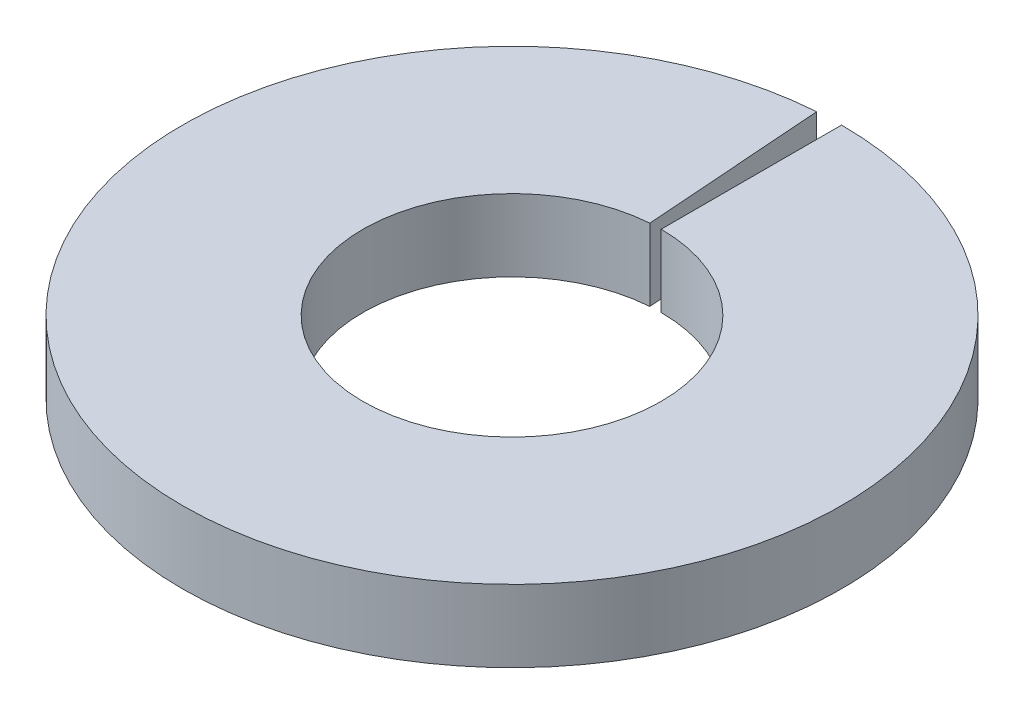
from build123d import *

# Parameters (mm, degrees)
BOSS_EXTRUDE1_DEPTH = 0.381


with BuildPart() as part:
    # Sketch1 → Boss-Extrude1 (new body)
    with BuildSketch(Plane(origin=(0, 0, 0), x_dir=(1, 0, 0), z_dir=(0, 1, 0))):
        with BuildLine():
            Line((-0.057474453, 0.785299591), (-0.127, 1.735258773))
            ThreePointArc((-0.127, 1.735258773), (0.063542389, -1.738739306), (0, 1.7399))
            Line((0, 1.7399), (0, 0.7874))
            ThreePointArc((0, 0.7874), (0.02875641, -0.786874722), (-0.057474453, 0.785299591))
        make_face()
    extrude(amount=BOSS_EXTRUDE1_DEPTH)


solid = part.part
